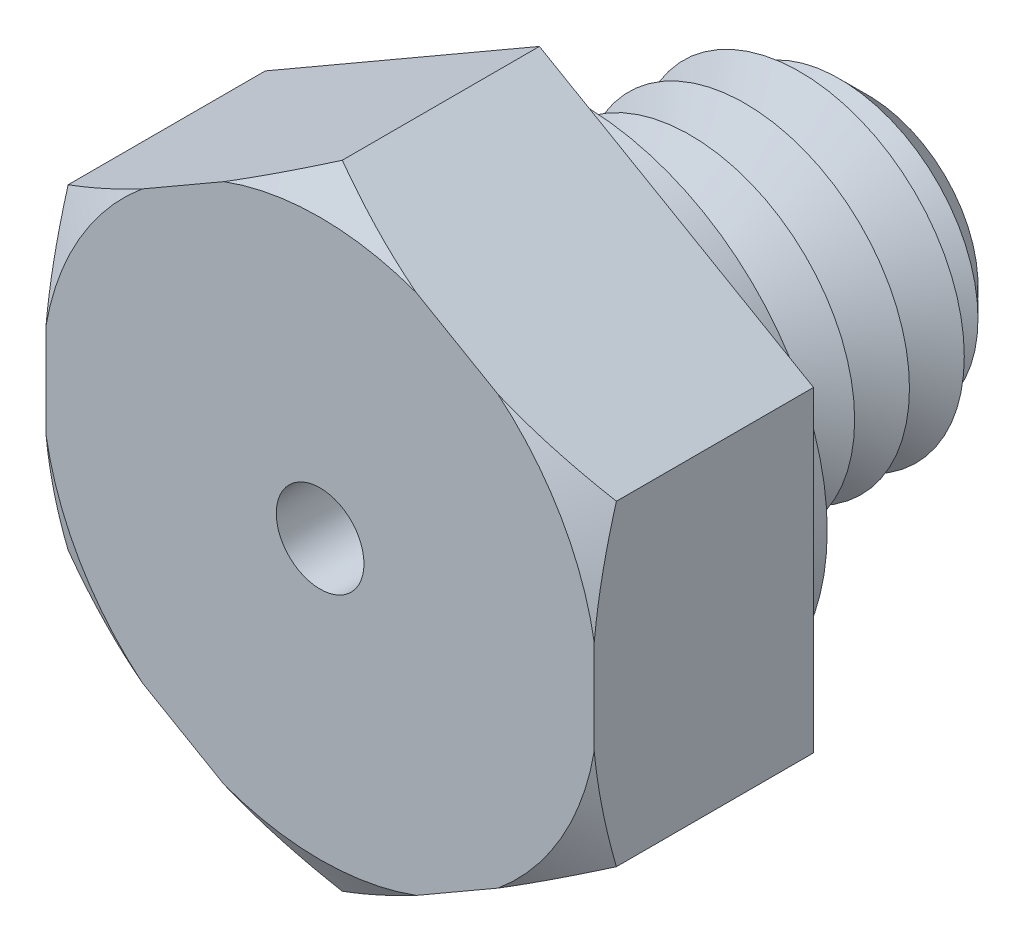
from build123d import *

# Parameters (mm, degrees)
BOSS_EXTRUDE1_DEPTH = 4
SKETCH3_R           = 3
BOSS_EXTRUDE2_DEPTH = 6
SKETCH4_R           = 4.5
BOSS_EXTRUDE3_DEPTH = 0.75
CHAMFER1_SIZE       = 1
LPATTERN1_COUNT     = 5
LPATTERN1_PITCH     = 1
SKETCH8_R           = 0.8
CUT_EXTRUDE1_DEPTH  = 10


with BuildPart() as part:
    # Sketch2 → Boss-Extrude1 (new body)
    with BuildSketch(Plane.XY):
        Polygon((0, 5.773502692), (-5, 2.886751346), (-5, -2.886751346), (0, -5.773502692), (5, -2.886751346), (5, 2.886751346), align=None)
    extrude(amount=BOSS_EXTRUDE1_DEPTH)

    # Sketch3 → Boss-Extrude2 (add)
    with BuildSketch(Plane(origin=(0, 0, 0), x_dir=(-1, 0, 0), z_dir=(0, 0, -1))):
        Circle(SKETCH3_R)
    extrude(amount=BOSS_EXTRUDE2_DEPTH)

    # Sketch4 → Boss-Extrude3 (add)
    with BuildSketch(Plane(origin=(0, 0, 0), x_dir=(-1, 0, 0), z_dir=(0, 0, -1))):
        with Locations(Location((0, 0, 0), (0, 0, 180))):
            Circle(SKETCH4_R)
    extrude(amount=BOSS_EXTRUDE3_DEPTH)

    # Chamfer1
    chamfer1_edges = [part.edges().sort_by_distance(p)[0] for p in [
        (3, 0, -6),
    ]]
    chamfer(chamfer1_edges, length=CHAMFER1_SIZE)

    # Sketch6 → Cut-Revolve1 (revolve, cut)
    with BuildSketch(Plane(origin=(0, 0, 0), x_dir=(0, 0, -1), z_dir=(1, 0, 0)), mode=Mode.PRIVATE) as cut_revolve1_sk:
        Polygon((0.75, 3), (1.25, 2.133974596), (1.75, 3), align=None)
    cut_revolve1 = revolve(cut_revolve1_sk.sketch.rotate(Axis((0, 0, 3.211670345), (0, 0, -1)), 90), axis=Axis((0, 0, 3.211670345), (0, 0, -1)), mode=Mode.SUBTRACT)

    # LPattern1: Cut-Revolve1 ×5
    with Locations(*[(0, 0, -i * LPATTERN1_PITCH) for i in range(1, LPATTERN1_COUNT)]):
        add(cut_revolve1, mode=Mode.SUBTRACT)

    # Sketch7 → Cut-Revolve2 (revolve, cut)
    with BuildSketch(Plane(origin=(0, 0, 0), x_dir=(0, 0, -1), z_dir=(1, 0, 0)), mode=Mode.PRIVATE) as cut_revolve2_sk:
        Polygon((-4, 5.773502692), (-4, 5.073502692), (-3.595854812, 5.773502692), align=None)
    revolve(cut_revolve2_sk.sketch.rotate(Axis((0, 0, 3.211670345), (0, 0, -1)), 270), axis=Axis((0, 0, 3.211670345), (0, 0, -1)), mode=Mode.SUBTRACT)

    # Sketch8 → Cut-Extrude1 (cut)
    with BuildSketch(Plane.XY.offset(4)):
        Circle(SKETCH8_R)
    extrude(amount=-CUT_EXTRUDE1_DEPTH, mode=Mode.SUBTRACT)


solid = part.part
